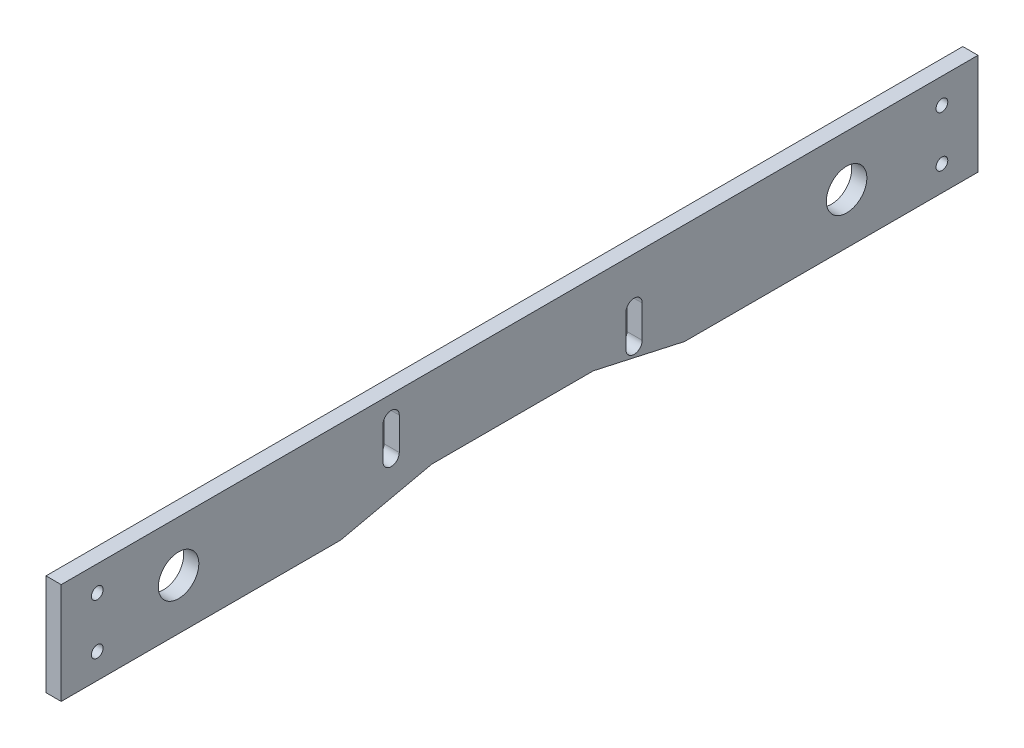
from build123d import *

# Parameters (mm, degrees)
SKETCH1_W           = 287.5915
SKETCH1_H           = 31.75
BOSS_EXTRUDE1_DEPTH = 4.7625
SKETCH2_R           = 6.35
CUT_EXTRUDE1_DEPTH  = 145.747762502
SKETCH3_R           = 1.8415
CUT_EXTRUDE2_DEPTH  = 145.747762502
CUT_EXTRUDE3_DEPTH  = 145.747762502
CUT_EXTRUDE4_DEPTH  = 145.747762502


with BuildPart() as part:
    # Sketch1 → Boss-Extrude1 (new body)
    with BuildSketch(Plane(origin=(0, 0, 0), x_dir=(0, 0, -1), z_dir=(1, 0, 0))):
        Rectangle(SKETCH1_W, SKETCH1_H)
    extrude(amount=BOSS_EXTRUDE1_DEPTH)

    # Sketch2 → Cut-Extrude1 (cut, through all)
    with BuildSketch(Plane(origin=(4.7625, 0, 0), x_dir=(0, 0, -1), z_dir=(1, 0, 0))):
        with Locations((-106.96575, 0)):
            Circle(SKETCH2_R)
        with Locations((102.58425, 0)):
            Circle(SKETCH2_R)
    extrude(amount=-CUT_EXTRUDE1_DEPTH, mode=Mode.SUBTRACT)

    # Sketch3 → Cut-Extrude2 (cut, through all)
    with BuildSketch(Plane.ZY):
        with Locations((-132.4737, 7.9375)):
            Circle(SKETCH3_R)
        with Locations((-132.4737, -7.9375)):
            Circle(SKETCH3_R)
        with Locations((132.4737, -7.9375)):
            Circle(SKETCH3_R)
        with Locations((132.4737, 7.9375)):
            Circle(SKETCH3_R)
    extrude(amount=-CUT_EXTRUDE2_DEPTH, mode=Mode.SUBTRACT)

    # Sketch4 → Cut-Extrude3 (cut, through all)
    with BuildSketch(Plane.ZY):
        with BuildLine():
            Line((37.73805, 8.89), (37.73805, -1.27))
            ThreePointArc((37.73805, -1.27), (40.29075, -3.8227), (42.84345, -1.27))
            Line((42.84345, -1.27), (42.84345, 8.89))
            ThreePointArc((42.84345, 8.89), (40.29075, 11.4427), (37.73805, 8.89))
        make_face()
        with BuildLine():
            Line((-38.46195, 1.27), (-38.46195, -8.89))
            ThreePointArc((-38.46195, -8.89), (-35.90925, -11.4427), (-33.35655, -8.89))
            Line((-33.35655, -8.89), (-33.35655, 1.27))
            ThreePointArc((-33.35655, 1.27), (-35.90925, 3.8227), (-38.46195, 1.27))
        make_face()
    extrude(amount=-CUT_EXTRUDE3_DEPTH, mode=Mode.SUBTRACT)

    # Sketch5 → Cut-Extrude4 (cut, through all)
    with BuildSketch(Plane.ZY):
        Polygon((-51.78425, -15.875), (-23.141251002, -9.525), (27.522751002, -9.525), (56.16575, -15.875), align=None)
    extrude(amount=-CUT_EXTRUDE4_DEPTH, mode=Mode.SUBTRACT)


solid = part.part
